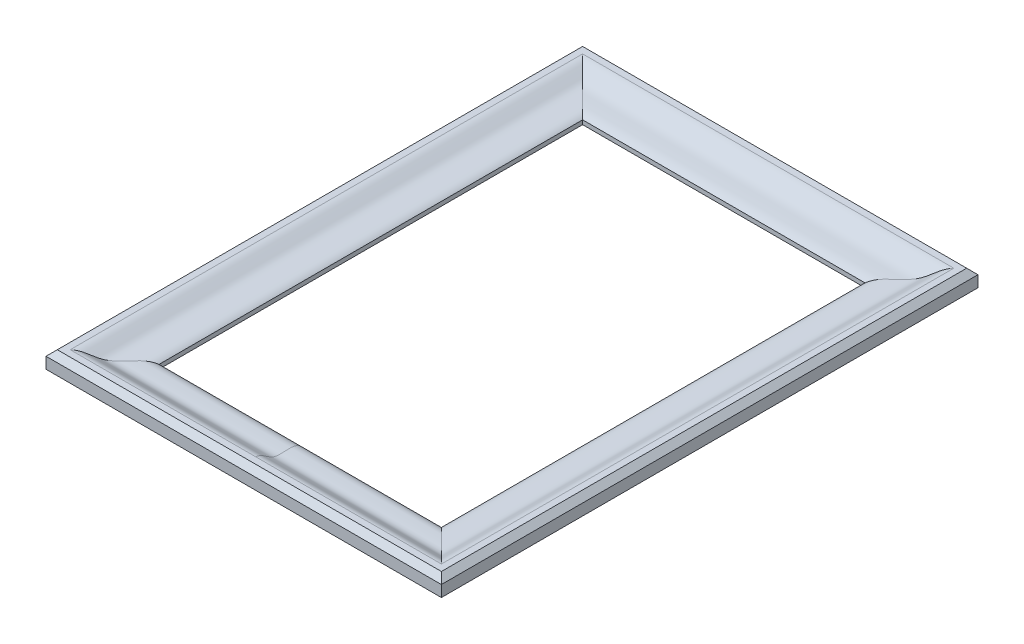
from build123d import *

# Parameters (mm, degrees)
CHAMFER1_SIZE = 2


with BuildPart() as part:
    # Sweep1: sweep along a path in Sketch1
    with BuildLine(Plane(origin=(0, 0, 0), x_dir=(1, 0, 0), z_dir=(0, 1, 0))) as sweep1_path:
        Line((-50, 0), (50, 0))
        Line((50, 0), (50, 150))
        Line((50, 150), (-50, 150))
        Line((-50, 150), (-50, 0))
    # Sketch2 → Sweep1 (sweep)
    with BuildSketch(Plane(origin=(0, 0, 0), x_dir=(0, 0, -1), z_dir=(1, 0, 0))):
        with BuildLine():
            Line((0, 0), (-20, 0))
            Line((-20, 0), (-20, 6))
            Line((-20, 6), (-15.71403392, 6))
            add(Edge.make_bspline(
                [(-15.71403392, 6), (-14.194735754, 5.931239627), (-12.29661625, 4.472047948), (-7.592930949, 1.342432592), (-2.7638878, 3.732601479), (0, 1.49398783)],
                knots=[0.019756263, 0.019756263, 0.019756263, 0.019756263, 0.277587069, 0.41920214, 1, 1, 1, 1], degree=3))
            Line((0, 1.49398783), (0, 0))
        make_face()
    sweep(path=sweep1_path.line, transition=Transition.RIGHT)

    # Chamfer1
    chamfer1_edges = [part.edges().sort_by_distance(p)[0] for p in [
        (-70, 6, -75),
        (0, 6, -170),
        (0, 6, 20),
        (70, 6, -75),
    ]]
    chamfer(chamfer1_edges, length=CHAMFER1_SIZE)


solid = part.part
